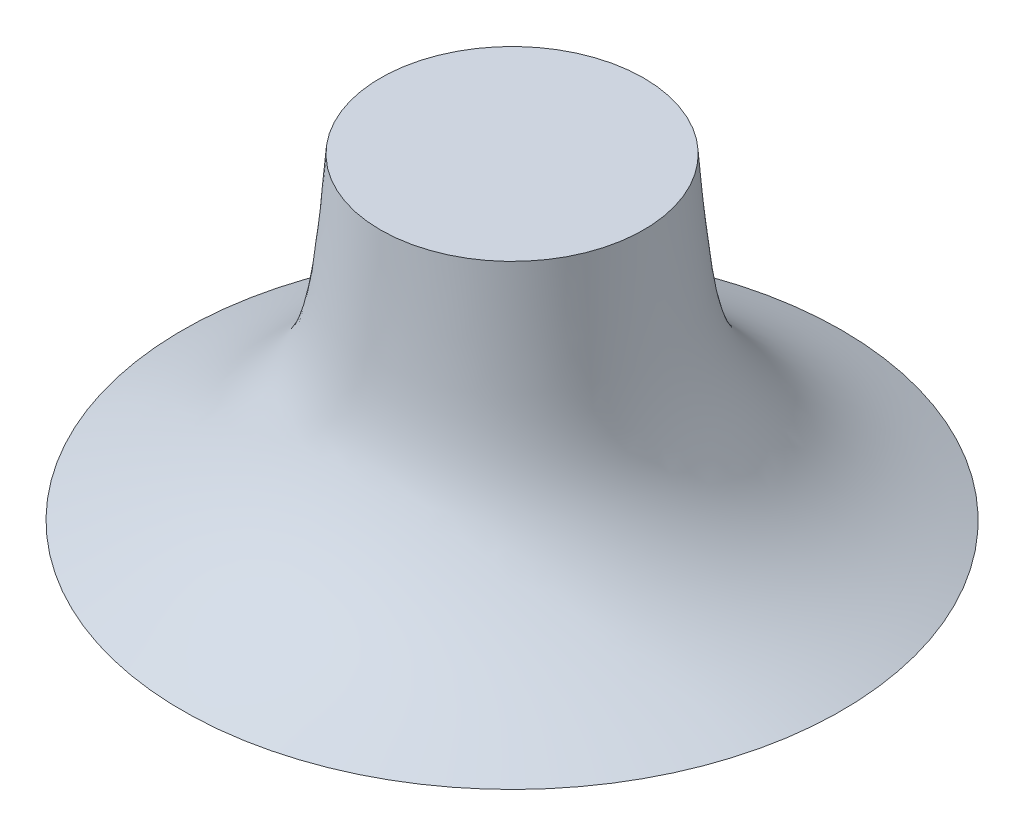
ISO-10303-21;
HEADER;
FILE_DESCRIPTION(('STEP AP214'),'2;1');
FILE_NAME('part.step','',(''),(''),'','','');
FILE_SCHEMA(('AUTOMOTIVE_DESIGN { 1 0 10303 214 1 1 1 1 }'));
ENDSEC;
DATA;
#1=APPLICATION_CONTEXT('core data for automotive mechanical design processes');
#2=APPLICATION_PROTOCOL_DEFINITION('international standard','automotive_design',2000,#1);
#3=PRODUCT_CONTEXT('',#1,'mechanical');
#4=PRODUCT('Part','Part','',(#3));
#5=PRODUCT_RELATED_PRODUCT_CATEGORY('part','',(#4));
#6=PRODUCT_DEFINITION_FORMATION('','',#4);
#7=PRODUCT_DEFINITION_CONTEXT('part definition',#1,'design');
#8=PRODUCT_DEFINITION('design','',#6,#7);
#9=PRODUCT_DEFINITION_SHAPE('','',#8);
#10=(LENGTH_UNIT() NAMED_UNIT(*) SI_UNIT(.MILLI.,.METRE.));
#11=(NAMED_UNIT(*) PLANE_ANGLE_UNIT() SI_UNIT($,.RADIAN.));
#12=(NAMED_UNIT(*) SI_UNIT($,.STERADIAN.) SOLID_ANGLE_UNIT());
#13=UNCERTAINTY_MEASURE_WITH_UNIT(LENGTH_MEASURE(1.E-05),#10,'distance_accuracy_value','');
#14=(GEOMETRIC_REPRESENTATION_CONTEXT(3) GLOBAL_UNCERTAINTY_ASSIGNED_CONTEXT((#13)) GLOBAL_UNIT_ASSIGNED_CONTEXT((#10,
#11,#12)) REPRESENTATION_CONTEXT('',''));
#15=CARTESIAN_POINT('',(0.,0.,0.));
#16=DIRECTION('',(0.,0.,1.));
#17=DIRECTION('',(1.,0.,0.));
#18=AXIS2_PLACEMENT_3D('',#15,#16,#17);
#19=CARTESIAN_POINT('',(2.42167685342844,84.7785714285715,0.));
#20=DIRECTION('',(0.,-1.,0.));
#21=DIRECTION('',(0.,0.,-1.));
#22=AXIS2_PLACEMENT_3D('',#19,#20,#21);
#23=PLANE('',#22);
#24=CARTESIAN_POINT('',(2.42167685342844,84.7785714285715,0.));
#25=DIRECTION('',(0.,-1.,0.));
#26=DIRECTION('',(0.,0.,-1.));
#27=AXIS2_PLACEMENT_3D('',#24,#25,#26);
#28=CIRCLE('',#27,39.4028817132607);
#29=CARTESIAN_POINT('',(2.42167685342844,84.7785714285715,-39.4028817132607));
#30=VERTEX_POINT('',#29);
#31=EDGE_CURVE('E47',#30,#30,#28,.T.);
#32=ORIENTED_EDGE('',*,*,#31,.F.);
#33=EDGE_LOOP('',(#32));
#34=FACE_BOUND('',#33,.T.);
#35=ADVANCED_FACE('F35',(#34),#23,.F.);
#36=CARTESIAN_POINT('',(-36.9812048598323,84.7785714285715,0.));
#37=CARTESIAN_POINT('',(-37.1762893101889,82.3063000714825,0.));
#38=CARTESIAN_POINT('',(-37.9084440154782,73.1510872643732,0.));
#39=CARTESIAN_POINT('',(-39.5987081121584,54.6948103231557,0.));
#40=CARTESIAN_POINT('',(-43.3665644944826,28.9862597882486,0.));
#41=CARTESIAN_POINT('',(-63.6138363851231,5.55382714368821,0.));
#42=CARTESIAN_POINT('',(-83.2198535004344,-4.30122562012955,0.));
#43=CARTESIAN_POINT('',(-94.7597441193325,-9.55101381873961,0.));
#44=CARTESIAN_POINT('',(-96.2374976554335,-10.2214285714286,0.));
#45=B_SPLINE_CURVE_WITH_KNOTS('',3,(#36,#37,#38,#39,#40,#41,#42,#43,#44),.UNSPECIFIED.,.F.,.F.,
(4,1,1,1,1,1,4),(0.066076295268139,0.120006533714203,0.266266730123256,0.47069565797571,
0.669640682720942,0.909190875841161,0.944397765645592),.UNSPECIFIED.);
#46=CARTESIAN_POINT('',(2.42167685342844,-10.2214285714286,0.));
#47=DIRECTION('',(0.,-1.,0.));
#48=AXIS1_PLACEMENT('',#46,#47);
#49=SURFACE_OF_REVOLUTION('',#45,#48);
#50=CARTESIAN_POINT('',(2.42167685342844,-10.2214285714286,0.));
#51=DIRECTION('',(0.,-1.,0.));
#52=DIRECTION('',(0.,0.,-1.));
#53=AXIS2_PLACEMENT_3D('',#50,#51,#52);
#54=CIRCLE('',#53,98.6591745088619);
#55=CARTESIAN_POINT('',(2.42167685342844,-10.2214285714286,-98.6591745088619));
#56=VERTEX_POINT('',#55);
#57=EDGE_CURVE('E51',#56,#56,#54,.T.);
#58=ORIENTED_EDGE('',*,*,#57,.F.);
#59=EDGE_LOOP('',(#58));
#60=FACE_BOUND('',#59,.T.);
#61=ORIENTED_EDGE('',*,*,#31,.T.);
#62=EDGE_LOOP('',(#61));
#63=FACE_BOUND('',#62,.T.);
#64=ADVANCED_FACE('F67',(#60,#63),#49,.T.);
#65=CARTESIAN_POINT('',(2.42167685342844,-10.2214285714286,0.));
#66=DIRECTION('',(0.,1.,0.));
#67=DIRECTION('',(0.,0.,1.));
#68=AXIS2_PLACEMENT_3D('',#65,#66,#67);
#69=PLANE('',#68);
#70=ORIENTED_EDGE('',*,*,#57,.T.);
#71=EDGE_LOOP('',(#70));
#72=FACE_BOUND('',#71,.T.);
#73=ADVANCED_FACE('F71',(#72),#69,.F.);
#74=CLOSED_SHELL('',(#35,#64,#73));
#75=CARTESIAN_POINT('',(2.42167685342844,-7.22142857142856,0.));
#76=DIRECTION('',(0.,-1.,0.));
#77=DIRECTION('',(0.,0.,-1.));
#78=AXIS2_PLACEMENT_3D('',#75,#76,#77);
#79=PLANE('',#78);
#80=CARTESIAN_POINT('',(2.42167685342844,-7.22142857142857,0.));
#81=DIRECTION('',(0.,-1.,0.));
#82=DIRECTION('',(0.,0.,-1.));
#83=AXIS2_PLACEMENT_3D('',#80,#81,#82);
#84=CIRCLE('',#83,85.204152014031);
#85=CARTESIAN_POINT('',(2.42167685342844,-7.22142857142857,-85.204152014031));
#86=VERTEX_POINT('',#85);
#87=EDGE_CURVE('E10',#86,#86,#84,.T.);
#88=ORIENTED_EDGE('',*,*,#87,.F.);
#89=EDGE_LOOP('',(#88));
#90=FACE_BOUND('',#89,.T.);
#91=ADVANCED_FACE('F37',(#90),#79,.F.);
#92=CARTESIAN_POINT('',(-82.7824751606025,-7.22142857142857,0.));
#93=CARTESIAN_POINT('',(-78.770827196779,-5.22669501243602,0.));
#94=CARTESIAN_POINT('',(-70.9034809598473,-0.997883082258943,0.));
#95=CARTESIAN_POINT('',(-59.7419149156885,6.9165905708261,0.));
#96=CARTESIAN_POINT('',(-51.5397316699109,15.2514214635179,0.));
#97=CARTESIAN_POINT('',(-46.1669618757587,22.8288933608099,0.));
#98=CARTESIAN_POINT('',(-42.8593991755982,28.9763535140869,0.));
#99=CARTESIAN_POINT('',(-40.4446705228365,35.4569270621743,0.));
#100=CARTESIAN_POINT('',(-38.169288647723,44.3108204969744,0.));
#101=CARTESIAN_POINT('',(-36.6171287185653,55.5607171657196,0.));
#102=CARTESIAN_POINT('',(-35.2881947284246,68.697313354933,0.));
#103=CARTESIAN_POINT('',(-34.5591658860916,77.4126983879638,0.));
#104=CARTESIAN_POINT('',(-34.2099612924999,81.7785714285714,0.));
#105=B_SPLINE_CURVE_WITH_KNOTS('',3,(#92,#93,#94,#95,#96,#97,#98,#99,#100,#101,#102,#103,#104),
.UNSPECIFIED.,.F.,.F.,(4,1,1,1,1,1,1,1,1,1,4),(0.162761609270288,0.257954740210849,
0.353147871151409,0.44834100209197,0.495937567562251,0.543534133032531,0.591130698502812,
0.638727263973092,0.733920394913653,0.829113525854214,0.924306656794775),.UNSPECIFIED.);
#106=CARTESIAN_POINT('',(2.42167685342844,-10.2214285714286,0.));
#107=DIRECTION('',(0.,-1.,0.));
#108=AXIS1_PLACEMENT('',#106,#107);
#109=SURFACE_OF_REVOLUTION('',#105,#108);
#110=CARTESIAN_POINT('',(2.42167685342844,81.7785714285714,0.));
#111=DIRECTION('',(0.,-1.,0.));
#112=DIRECTION('',(0.,0.,-1.));
#113=AXIS2_PLACEMENT_3D('',#110,#111,#112);
#114=CIRCLE('',#113,36.6316381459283);
#115=CARTESIAN_POINT('',(2.42167685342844,81.7785714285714,-36.6316381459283));
#116=VERTEX_POINT('',#115);
#117=EDGE_CURVE('E43',#116,#116,#114,.T.);
#118=ORIENTED_EDGE('',*,*,#117,.F.);
#119=EDGE_LOOP('',(#118));
#120=FACE_BOUND('',#119,.T.);
#121=ORIENTED_EDGE('',*,*,#87,.T.);
#122=EDGE_LOOP('',(#121));
#123=FACE_BOUND('',#122,.T.);
#124=ADVANCED_FACE('F78',(#120,#123),#109,.T.);
#125=CARTESIAN_POINT('',(2.42167685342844,81.7785714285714,0.));
#126=DIRECTION('',(0.,1.,0.));
#127=DIRECTION('',(0.,0.,1.));
#128=AXIS2_PLACEMENT_3D('',#125,#126,#127);
#129=PLANE('',#128);
#130=ORIENTED_EDGE('',*,*,#117,.T.);
#131=EDGE_LOOP('',(#130));
#132=FACE_BOUND('',#131,.T.);
#133=ADVANCED_FACE('F76',(#132),#129,.F.);
#134=CLOSED_SHELL('',(#91,#124,#133));
#135=ORIENTED_CLOSED_SHELL('',*,#134,.T.);
#136=BREP_WITH_VOIDS('B2',#74,(#135));
#137=ADVANCED_BREP_SHAPE_REPRESENTATION('',(#18,#136),#14);
#138=SHAPE_DEFINITION_REPRESENTATION(#9,#137);
ENDSEC;
END-ISO-10303-21;
